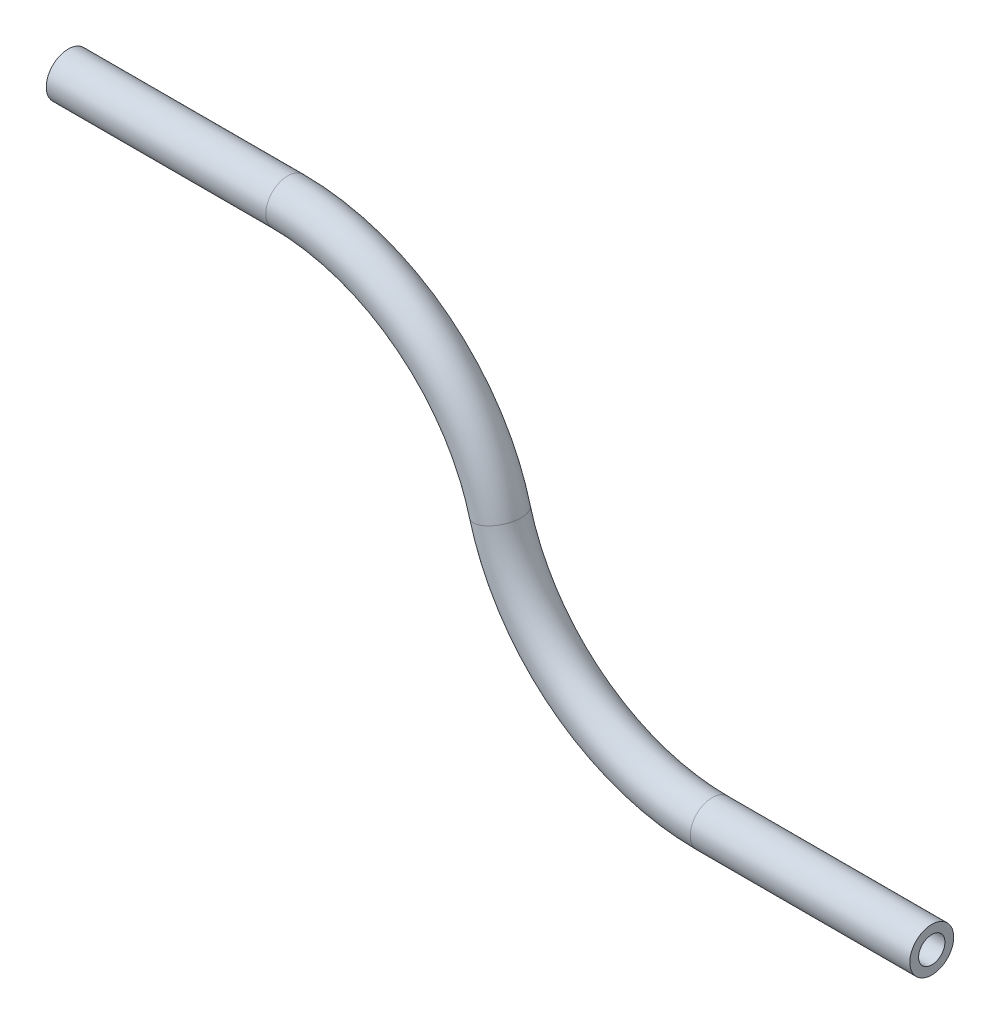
ISO-10303-21;
HEADER;
FILE_DESCRIPTION(('STEP AP214'),'2;1');
FILE_NAME('part.step','',(''),(''),'','','');
FILE_SCHEMA(('AUTOMOTIVE_DESIGN { 1 0 10303 214 1 1 1 1 }'));
ENDSEC;
DATA;
#1=APPLICATION_CONTEXT('core data for automotive mechanical design processes');
#2=APPLICATION_PROTOCOL_DEFINITION('international standard','automotive_design',2000,#1);
#3=PRODUCT_CONTEXT('',#1,'mechanical');
#4=PRODUCT('Part','Part','',(#3));
#5=PRODUCT_RELATED_PRODUCT_CATEGORY('part','',(#4));
#6=PRODUCT_DEFINITION_FORMATION('','',#4);
#7=PRODUCT_DEFINITION_CONTEXT('part definition',#1,'design');
#8=PRODUCT_DEFINITION('design','',#6,#7);
#9=PRODUCT_DEFINITION_SHAPE('','',#8);
#10=(LENGTH_UNIT() NAMED_UNIT(*) SI_UNIT(.MILLI.,.METRE.));
#11=(NAMED_UNIT(*) PLANE_ANGLE_UNIT() SI_UNIT($,.RADIAN.));
#12=(NAMED_UNIT(*) SI_UNIT($,.STERADIAN.) SOLID_ANGLE_UNIT());
#13=UNCERTAINTY_MEASURE_WITH_UNIT(LENGTH_MEASURE(1.E-05),#10,'distance_accuracy_value','');
#14=(GEOMETRIC_REPRESENTATION_CONTEXT(3) GLOBAL_UNCERTAINTY_ASSIGNED_CONTEXT((#13)) GLOBAL_UNIT_ASSIGNED_CONTEXT((#10,
#11,#12)) REPRESENTATION_CONTEXT('',''));
#15=CARTESIAN_POINT('',(0.,0.,0.));
#16=DIRECTION('',(0.,0.,1.));
#17=DIRECTION('',(1.,0.,0.));
#18=AXIS2_PLACEMENT_3D('',#15,#16,#17);
#19=CARTESIAN_POINT('',(146.640364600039,-74.29708324,0.));
#20=DIRECTION('',(1.,0.,0.));
#21=DIRECTION('',(0.,0.,-1.));
#22=AXIS2_PLACEMENT_3D('',#19,#20,#21);
#23=CYLINDRICAL_SURFACE('',#22,5.);
#24=CARTESIAN_POINT('',(146.640364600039,-74.29708324,0.));
#25=DIRECTION('',(1.,0.,0.));
#26=DIRECTION('',(0.,0.,-1.));
#27=AXIS2_PLACEMENT_3D('',#24,#25,#26);
#28=CIRCLE('',#27,5.);
#29=CARTESIAN_POINT('',(146.640364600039,-79.29708324,0.));
#30=VERTEX_POINT('',#29);
#31=EDGE_CURVE('E39',#30,#30,#28,.T.);
#32=ORIENTED_EDGE('',*,*,#31,.T.);
#33=EDGE_LOOP('',(#32));
#34=FACE_BOUND('',#33,.T.);
#35=CARTESIAN_POINT('',(196.640364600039,-74.29708324,0.));
#36=DIRECTION('',(1.,0.,0.));
#37=DIRECTION('',(0.,0.,-1.));
#38=AXIS2_PLACEMENT_3D('',#35,#36,#37);
#39=CIRCLE('',#38,5.);
#40=CARTESIAN_POINT('',(196.640364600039,-74.29708324,-5.));
#41=VERTEX_POINT('',#40);
#42=EDGE_CURVE('E10',#41,#41,#39,.T.);
#43=ORIENTED_EDGE('',*,*,#42,.F.);
#44=EDGE_LOOP('',(#43));
#45=FACE_BOUND('',#44,.T.);
#46=ADVANCED_FACE('F29',(#34,#45),#23,.T.);
#47=CARTESIAN_POINT('',(146.640364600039,-74.29708324,0.));
#48=DIRECTION('',(1.,0.,0.));
#49=DIRECTION('',(0.,0.,-1.));
#50=AXIS2_PLACEMENT_3D('',#47,#48,#49);
#51=CYLINDRICAL_SURFACE('',#50,3.);
#52=CARTESIAN_POINT('',(146.640364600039,-74.29708324,0.));
#53=DIRECTION('',(1.,0.,0.));
#54=DIRECTION('',(0.,0.,-1.));
#55=AXIS2_PLACEMENT_3D('',#52,#53,#54);
#56=CIRCLE('',#55,3.);
#57=CARTESIAN_POINT('',(146.640364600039,-77.29708324,0.));
#58=VERTEX_POINT('',#57);
#59=EDGE_CURVE('E43',#58,#58,#56,.T.);
#60=ORIENTED_EDGE('',*,*,#59,.F.);
#61=EDGE_LOOP('',(#60));
#62=FACE_BOUND('',#61,.T.);
#63=CARTESIAN_POINT('',(196.640364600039,-74.29708324,0.));
#64=DIRECTION('',(1.,0.,0.));
#65=DIRECTION('',(0.,0.,-1.));
#66=AXIS2_PLACEMENT_3D('',#63,#64,#65);
#67=CIRCLE('',#66,3.);
#68=CARTESIAN_POINT('',(196.640364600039,-74.29708324,-3.));
#69=VERTEX_POINT('',#68);
#70=EDGE_CURVE('E35',#69,#69,#67,.T.);
#71=ORIENTED_EDGE('',*,*,#70,.T.);
#72=EDGE_LOOP('',(#71));
#73=FACE_BOUND('',#72,.T.);
#74=ADVANCED_FACE('F84',(#62,#73),#51,.F.);
#75=CARTESIAN_POINT('',(146.640364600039,-24.29708324,0.));
#76=DIRECTION('',(0.,0.,1.));
#77=DIRECTION('',(1.,0.,0.));
#78=AXIS2_PLACEMENT_3D('',#75,#76,#77);
#79=TOROIDAL_SURFACE('',#78,50.,5.);
#80=CARTESIAN_POINT('',(98.3201823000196,-37.14854162,0.));
#81=DIRECTION('',(0.2570291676,-0.966403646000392,0.));
#82=DIRECTION('',(0.,0.,-1.));
#83=AXIS2_PLACEMENT_3D('',#80,#81,#82);
#84=CIRCLE('',#83,5.);
#85=CARTESIAN_POINT('',(93.4881640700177,-38.433687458,0.));
#86=VERTEX_POINT('',#85);
#87=EDGE_CURVE('E48',#86,#86,#84,.T.);
#88=CARTESIAN_POINT('',(146.640364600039,-24.29708324,0.));
#89=DIRECTION('',(0.,0.,1.));
#90=DIRECTION('',(1.,0.,0.));
#91=AXIS2_PLACEMENT_3D('',#88,#89,#90);
#92=CIRCLE('',#91,55.);
#93=EDGE_CURVE('',#86,#30,#92,.T.);
#94=ORIENTED_EDGE('',*,*,#87,.T.);
#95=ORIENTED_EDGE('',*,*,#31,.F.);
#96=ORIENTED_EDGE('',*,*,#93,.T.);
#97=ORIENTED_EDGE('',*,*,#93,.F.);
#98=EDGE_LOOP('',(#94,#96,#95,#97));
#99=FACE_BOUND('',#98,.T.);
#100=ADVANCED_FACE('F80',(#99),#79,.T.);
#101=CARTESIAN_POINT('',(146.640364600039,-24.29708324,0.));
#102=DIRECTION('',(0.,0.,1.));
#103=DIRECTION('',(1.,0.,0.));
#104=AXIS2_PLACEMENT_3D('',#101,#102,#103);
#105=TOROIDAL_SURFACE('',#104,50.,3.);
#106=CARTESIAN_POINT('',(98.3201823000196,-37.14854162,0.));
#107=DIRECTION('',(0.2570291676,-0.966403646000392,0.));
#108=DIRECTION('',(0.,0.,-1.));
#109=AXIS2_PLACEMENT_3D('',#106,#107,#108);
#110=CIRCLE('',#109,3.);
#111=CARTESIAN_POINT('',(95.4209713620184,-37.9196291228,0.));
#112=VERTEX_POINT('',#111);
#113=EDGE_CURVE('E51',#112,#112,#110,.T.);
#114=CARTESIAN_POINT('',(146.640364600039,-24.29708324,0.));
#115=DIRECTION('',(0.,0.,1.));
#116=DIRECTION('',(1.,0.,0.));
#117=AXIS2_PLACEMENT_3D('',#114,#115,#116);
#118=CIRCLE('',#117,53.);
#119=EDGE_CURVE('',#112,#58,#118,.T.);
#120=ORIENTED_EDGE('',*,*,#113,.F.);
#121=ORIENTED_EDGE('',*,*,#59,.T.);
#122=ORIENTED_EDGE('',*,*,#119,.T.);
#123=ORIENTED_EDGE('',*,*,#119,.F.);
#124=EDGE_LOOP('',(#120,#122,#121,#123));
#125=FACE_BOUND('',#124,.T.);
#126=ADVANCED_FACE('F77',(#125),#105,.F.);
#127=CARTESIAN_POINT('',(50.,-50.,0.));
#128=DIRECTION('',(0.,0.,-1.));
#129=DIRECTION('',(-1.,0.,0.));
#130=AXIS2_PLACEMENT_3D('',#127,#128,#129);
#131=TOROIDAL_SURFACE('',#130,50.,5.);
#132=CARTESIAN_POINT('',(50.,0.,0.));
#133=DIRECTION('',(1.,0.,0.));
#134=DIRECTION('',(0.,0.,-1.));
#135=AXIS2_PLACEMENT_3D('',#132,#133,#134);
#136=CIRCLE('',#135,5.);
#137=CARTESIAN_POINT('',(50.,0.,-5.));
#138=VERTEX_POINT('',#137);
#139=EDGE_CURVE('E54',#138,#138,#136,.T.);
#140=ORIENTED_EDGE('',*,*,#139,.T.);
#141=EDGE_LOOP('',(#140));
#142=FACE_BOUND('',#141,.T.);
#143=ORIENTED_EDGE('',*,*,#87,.F.);
#144=EDGE_LOOP('',(#143));
#145=FACE_BOUND('',#144,.T.);
#146=ADVANCED_FACE('F73',(#142,#145),#131,.T.);
#147=CARTESIAN_POINT('',(50.,-50.,0.));
#148=DIRECTION('',(0.,0.,-1.));
#149=DIRECTION('',(-1.,0.,0.));
#150=AXIS2_PLACEMENT_3D('',#147,#148,#149);
#151=TOROIDAL_SURFACE('',#150,50.,3.);
#152=CARTESIAN_POINT('',(50.,0.,0.));
#153=DIRECTION('',(1.,0.,0.));
#154=DIRECTION('',(0.,0.,-1.));
#155=AXIS2_PLACEMENT_3D('',#152,#153,#154);
#156=CIRCLE('',#155,3.);
#157=CARTESIAN_POINT('',(50.,0.,-3.));
#158=VERTEX_POINT('',#157);
#159=EDGE_CURVE('E58',#158,#158,#156,.T.);
#160=ORIENTED_EDGE('',*,*,#159,.F.);
#161=EDGE_LOOP('',(#160));
#162=FACE_BOUND('',#161,.T.);
#163=ORIENTED_EDGE('',*,*,#113,.T.);
#164=EDGE_LOOP('',(#163));
#165=FACE_BOUND('',#164,.T.);
#166=ADVANCED_FACE('F70',(#162,#165),#151,.F.);
#167=CARTESIAN_POINT('',(50.,0.,0.));
#168=DIRECTION('',(-1.,0.,0.));
#169=DIRECTION('',(0.,0.,1.));
#170=AXIS2_PLACEMENT_3D('',#167,#168,#169);
#171=CYLINDRICAL_SURFACE('',#170,3.);
#172=ORIENTED_EDGE('',*,*,#159,.T.);
#173=EDGE_LOOP('',(#172));
#174=FACE_BOUND('',#173,.T.);
#175=CARTESIAN_POINT('',(0.,0.,0.));
#176=DIRECTION('',(1.,0.,0.));
#177=DIRECTION('',(0.,0.,-1.));
#178=AXIS2_PLACEMENT_3D('',#175,#176,#177);
#179=CIRCLE('',#178,3.);
#180=CARTESIAN_POINT('',(0.,0.,-3.));
#181=VERTEX_POINT('',#180);
#182=EDGE_CURVE('E59',#181,#181,#179,.T.);
#183=ORIENTED_EDGE('',*,*,#182,.F.);
#184=EDGE_LOOP('',(#183));
#185=FACE_BOUND('',#184,.T.);
#186=ADVANCED_FACE('F67',(#174,#185),#171,.F.);
#187=CARTESIAN_POINT('',(50.,0.,0.));
#188=DIRECTION('',(-1.,0.,0.));
#189=DIRECTION('',(0.,0.,1.));
#190=AXIS2_PLACEMENT_3D('',#187,#188,#189);
#191=CYLINDRICAL_SURFACE('',#190,5.);
#192=ORIENTED_EDGE('',*,*,#139,.F.);
#193=EDGE_LOOP('',(#192));
#194=FACE_BOUND('',#193,.T.);
#195=CARTESIAN_POINT('',(0.,0.,0.));
#196=DIRECTION('',(1.,0.,0.));
#197=DIRECTION('',(0.,0.,-1.));
#198=AXIS2_PLACEMENT_3D('',#195,#196,#197);
#199=CIRCLE('',#198,5.);
#200=CARTESIAN_POINT('',(0.,0.,-5.));
#201=VERTEX_POINT('',#200);
#202=EDGE_CURVE('E55',#201,#201,#199,.T.);
#203=ORIENTED_EDGE('',*,*,#202,.T.);
#204=EDGE_LOOP('',(#203));
#205=FACE_BOUND('',#204,.T.);
#206=ADVANCED_FACE('F99',(#194,#205),#191,.T.);
#207=CARTESIAN_POINT('',(196.640364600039,-74.29708324,0.));
#208=DIRECTION('',(1.,0.,0.));
#209=DIRECTION('',(0.,0.,-1.));
#210=AXIS2_PLACEMENT_3D('',#207,#208,#209);
#211=PLANE('',#210);
#212=ORIENTED_EDGE('',*,*,#70,.F.);
#213=EDGE_LOOP('',(#212));
#214=FACE_BOUND('',#213,.T.);
#215=ORIENTED_EDGE('',*,*,#42,.T.);
#216=EDGE_LOOP('',(#215));
#217=FACE_BOUND('',#216,.T.);
#218=ADVANCED_FACE('F102',(#214,#217),#211,.T.);
#219=CARTESIAN_POINT('',(0.,0.,0.));
#220=DIRECTION('',(1.,0.,0.));
#221=DIRECTION('',(0.,0.,-1.));
#222=AXIS2_PLACEMENT_3D('',#219,#220,#221);
#223=PLANE('',#222);
#224=ORIENTED_EDGE('',*,*,#182,.T.);
#225=EDGE_LOOP('',(#224));
#226=FACE_BOUND('',#225,.T.);
#227=ORIENTED_EDGE('',*,*,#202,.F.);
#228=EDGE_LOOP('',(#227));
#229=FACE_BOUND('',#228,.T.);
#230=ADVANCED_FACE('F104',(#226,#229),#223,.F.);
#231=CLOSED_SHELL('',(#46,#74,#100,#126,#146,#166,#186,#206,#218,#230));
#232=MANIFOLD_SOLID_BREP('B2',#231);
#233=ADVANCED_BREP_SHAPE_REPRESENTATION('',(#18,#232),#14);
#234=SHAPE_DEFINITION_REPRESENTATION(#9,#233);
ENDSEC;
END-ISO-10303-21;
